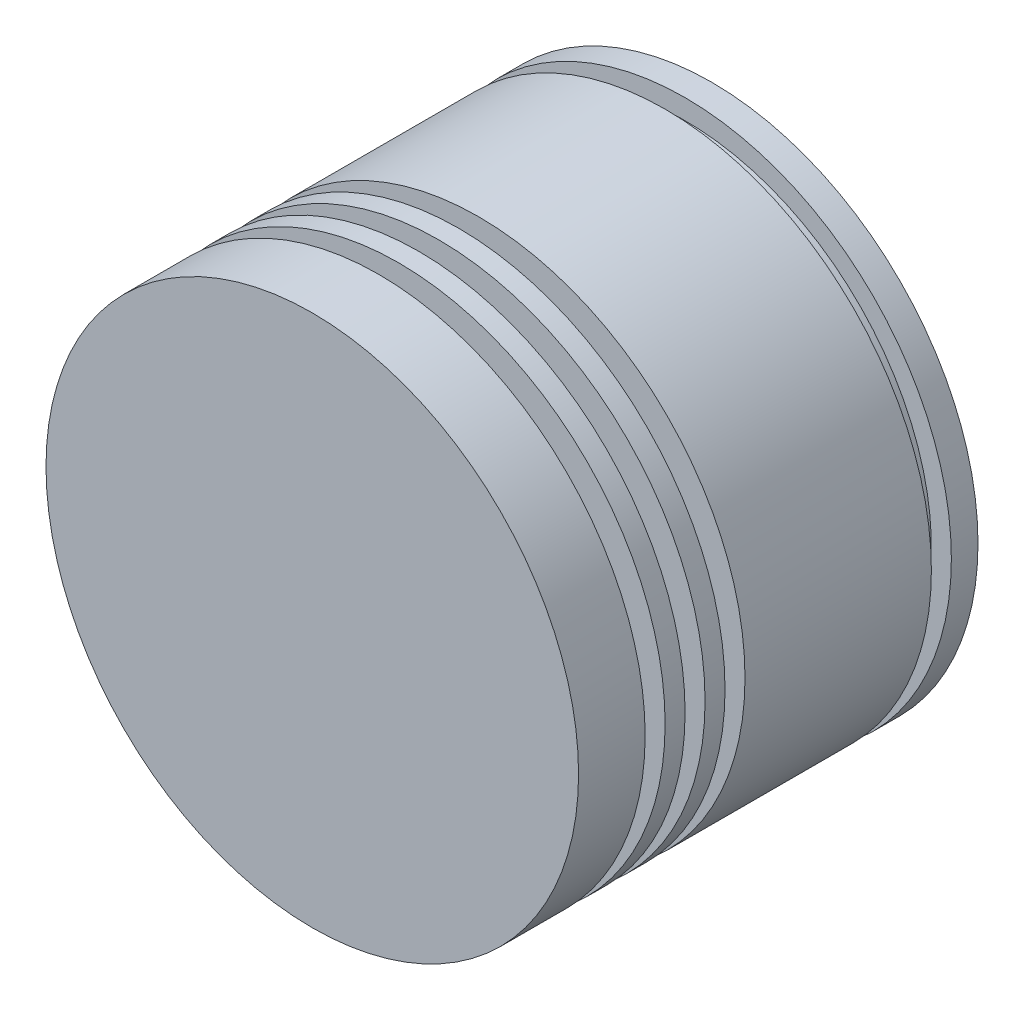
from build123d import *

# Parameters (mm, degrees)
SKIZZE1_R                       = 40
LINEAR_AUSTRAGEN1_DEPTH         = 60
SCHNITT_LINEAR_START            = -10
SKIZZE2_OUTSIDE_W               = 107.612
SKIZZE2_OUTSIDE_H               = 107.612
SKIZZE2_OUTSIDE_R               = 35
SCHNITT_LINEAR_AUSTRAGEN2_DEPTH = 3
LINEARES_MUSTER1_COUNT          = 3
LINEARES_MUSTER1_PITCH          = 6
SKIZZE3_W                       = 5
SKIZZE3_H                       = 3


with BuildPart() as part:
    # Skizze1 → Linear austragen1 (new body)
    with BuildSketch(Plane.XY):
        Circle(SKIZZE1_R)
    extrude(amount=-LINEAR_AUSTRAGEN1_DEPTH)

    # Skizze2 outside → Schnitt-Linear austragen2 (cut)
    with BuildSketch(Plane.XY.offset(SCHNITT_LINEAR_START)):
        Rectangle(SKIZZE2_OUTSIDE_W, SKIZZE2_OUTSIDE_H)
        Circle(SKIZZE2_OUTSIDE_R, mode=Mode.SUBTRACT)
    schnitt_linear_austragen2 = extrude(amount=-SCHNITT_LINEAR_AUSTRAGEN2_DEPTH, mode=Mode.SUBTRACT)

    # Lineares Muster1: Schnitt-Linear austragen2 ×3
    with Locations(*[(0, 0, -i * LINEARES_MUSTER1_PITCH) for i in range(1, LINEARES_MUSTER1_COUNT)]):
        add(schnitt_linear_austragen2, mode=Mode.SUBTRACT)

    # Skizze3 → Schnitt-Rotation1 (revolve, cut)
    with BuildSketch(Plane(origin=(0, 0, 0), x_dir=(1, 0, 0), z_dir=(0, 1, 0)), mode=Mode.PRIVATE) as schnitt_rotation1_sk:
        with Locations((-39.5, 54.5)):
            Rectangle(SKIZZE3_W, SKIZZE3_H)
    revolve(schnitt_rotation1_sk.sketch.rotate(Axis((0, 0, -60), (0, 0, 1)), 180), axis=Axis((0, 0, -60), (0, 0, 1)), mode=Mode.SUBTRACT)


solid = part.part
